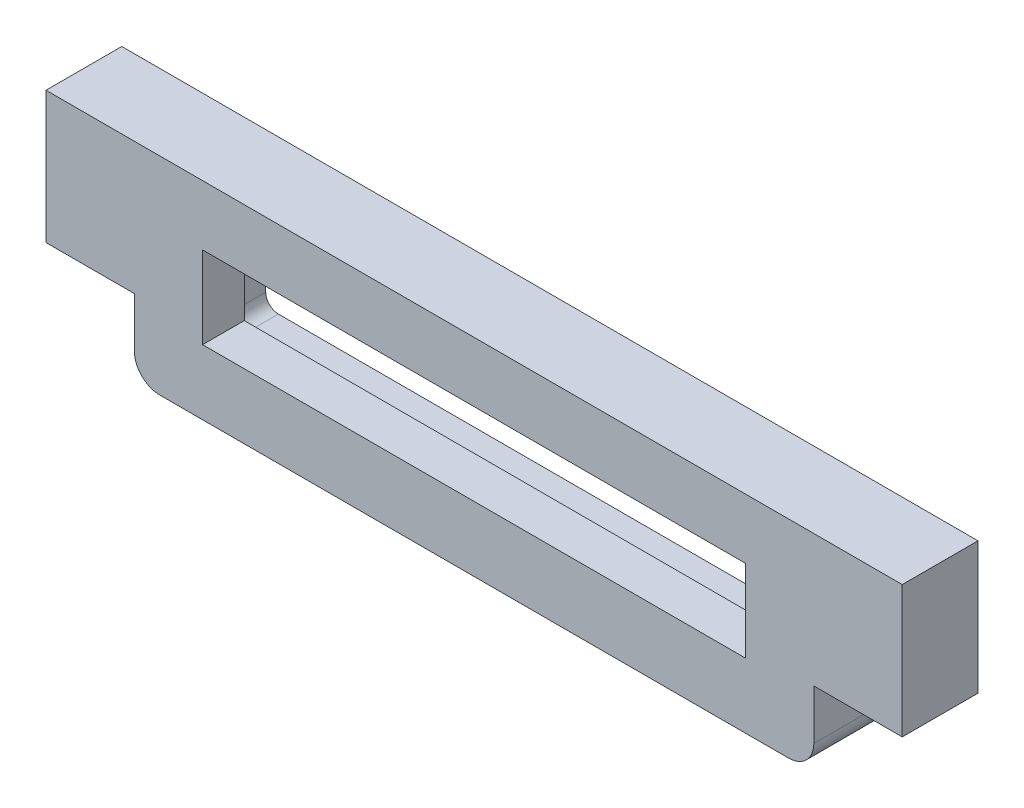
ISO-10303-21;
HEADER;
FILE_DESCRIPTION(('STEP AP214'),'2;1');
FILE_NAME('part.step','',(''),(''),'','','');
FILE_SCHEMA(('AUTOMOTIVE_DESIGN { 1 0 10303 214 1 1 1 1 }'));
ENDSEC;
DATA;
#1=APPLICATION_CONTEXT('core data for automotive mechanical design processes');
#2=APPLICATION_PROTOCOL_DEFINITION('international standard','automotive_design',2000,#1);
#3=PRODUCT_CONTEXT('',#1,'mechanical');
#4=PRODUCT('Part','Part','',(#3));
#5=PRODUCT_RELATED_PRODUCT_CATEGORY('part','',(#4));
#6=PRODUCT_DEFINITION_FORMATION('','',#4);
#7=PRODUCT_DEFINITION_CONTEXT('part definition',#1,'design');
#8=PRODUCT_DEFINITION('design','',#6,#7);
#9=PRODUCT_DEFINITION_SHAPE('','',#8);
#10=(LENGTH_UNIT() NAMED_UNIT(*) SI_UNIT(.MILLI.,.METRE.));
#11=(NAMED_UNIT(*) PLANE_ANGLE_UNIT() SI_UNIT($,.RADIAN.));
#12=(NAMED_UNIT(*) SI_UNIT($,.STERADIAN.) SOLID_ANGLE_UNIT());
#13=UNCERTAINTY_MEASURE_WITH_UNIT(LENGTH_MEASURE(1.E-05),#10,'distance_accuracy_value','');
#14=(GEOMETRIC_REPRESENTATION_CONTEXT(3) GLOBAL_UNCERTAINTY_ASSIGNED_CONTEXT((#13)) GLOBAL_UNIT_ASSIGNED_CONTEXT((#10,
#11,#12)) REPRESENTATION_CONTEXT('',''));
#15=CARTESIAN_POINT('',(0.,0.,0.));
#16=DIRECTION('',(0.,0.,1.));
#17=DIRECTION('',(1.,0.,0.));
#18=AXIS2_PLACEMENT_3D('',#15,#16,#17);
#19=CARTESIAN_POINT('',(-26.9,8.4,27.));
#20=DIRECTION('',(1.,0.,0.));
#21=DIRECTION('',(0.,0.,-1.));
#22=AXIS2_PLACEMENT_3D('',#19,#20,#21);
#23=PLANE('',#22);
#24=DIRECTION('',(0.,0.,-1.));
#25=VECTOR('',#24,1.);
#26=CARTESIAN_POINT('',(-26.9,-6.4,27.));
#27=LINE('',#26,#25);
#28=CARTESIAN_POINT('',(-26.9,-6.4,19.35));
#29=VERTEX_POINT('',#28);
#30=CARTESIAN_POINT('',(-26.9,-6.4,25.35));
#31=VERTEX_POINT('',#30);
#32=EDGE_CURVE('E325',#29,#31,#27,.F.);
#33=ORIENTED_EDGE('',*,*,#32,.T.);
#34=DIRECTION('',(0.,-1.,0.));
#35=VECTOR('',#34,1.);
#36=CARTESIAN_POINT('',(-26.9,-8.4,25.35));
#37=LINE('',#36,#35);
#38=CARTESIAN_POINT('',(-26.9,-2.44999999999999,25.35));
#39=VERTEX_POINT('',#38);
#40=EDGE_CURVE('E251',#39,#31,#37,.T.);
#41=ORIENTED_EDGE('',*,*,#40,.F.);
#42=DIRECTION('',(0.,0.,-1.));
#43=VECTOR('',#42,1.);
#44=CARTESIAN_POINT('',(-26.9,-2.44999999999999,25.35));
#45=LINE('',#44,#43);
#46=CARTESIAN_POINT('',(-26.9,-2.44999999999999,19.35));
#47=VERTEX_POINT('',#46);
#48=EDGE_CURVE('E290',#39,#47,#45,.T.);
#49=ORIENTED_EDGE('',*,*,#48,.T.);
#50=DIRECTION('',(0.,-1.,0.));
#51=VECTOR('',#50,1.);
#52=CARTESIAN_POINT('',(-26.9,8.4,19.35));
#53=LINE('',#52,#51);
#54=EDGE_CURVE('E305',#47,#29,#53,.T.);
#55=ORIENTED_EDGE('',*,*,#54,.T.);
#56=EDGE_LOOP('',(#33,#41,#49,#55));
#57=FACE_BOUND('',#56,.T.);
#58=ADVANCED_FACE('F39',(#57),#23,.F.);
#59=CARTESIAN_POINT('',(26.9,8.4,27.));
#60=DIRECTION('',(-1.,0.,0.));
#61=DIRECTION('',(0.,0.,1.));
#62=AXIS2_PLACEMENT_3D('',#59,#60,#61);
#63=PLANE('',#62);
#64=DIRECTION('',(0.,0.,-1.));
#65=VECTOR('',#64,1.);
#66=CARTESIAN_POINT('',(26.9,-2.45,25.35));
#67=LINE('',#66,#65);
#68=CARTESIAN_POINT('',(26.9,-2.45,25.35));
#69=VERTEX_POINT('',#68);
#70=CARTESIAN_POINT('',(26.9,-2.45,19.35));
#71=VERTEX_POINT('',#70);
#72=EDGE_CURVE('E302',#69,#71,#67,.T.);
#73=ORIENTED_EDGE('',*,*,#72,.F.);
#74=DIRECTION('',(0.,1.,0.));
#75=VECTOR('',#74,1.);
#76=CARTESIAN_POINT('',(26.9,-8.4,25.35));
#77=LINE('',#76,#75);
#78=CARTESIAN_POINT('',(26.9,-6.4,25.35));
#79=VERTEX_POINT('',#78);
#80=EDGE_CURVE('E262',#79,#69,#77,.T.);
#81=ORIENTED_EDGE('',*,*,#80,.F.);
#82=DIRECTION('',(0.,0.,-1.));
#83=VECTOR('',#82,1.);
#84=CARTESIAN_POINT('',(26.9,-6.4,27.));
#85=LINE('',#84,#83);
#86=CARTESIAN_POINT('',(26.9,-6.4,19.35));
#87=VERTEX_POINT('',#86);
#88=EDGE_CURVE('E314',#79,#87,#85,.T.);
#89=ORIENTED_EDGE('',*,*,#88,.T.);
#90=DIRECTION('',(0.,1.,0.));
#91=VECTOR('',#90,1.);
#92=CARTESIAN_POINT('',(26.9,-8.4,19.35));
#93=LINE('',#92,#91);
#94=EDGE_CURVE('E312',#87,#71,#93,.T.);
#95=ORIENTED_EDGE('',*,*,#94,.T.);
#96=EDGE_LOOP('',(#73,#81,#89,#95));
#97=FACE_BOUND('',#96,.T.);
#98=ADVANCED_FACE('F394',(#97),#63,.F.);
#99=CARTESIAN_POINT('',(26.9,-8.4,27.));
#100=DIRECTION('',(0.,1.,0.));
#101=DIRECTION('',(0.,0.,1.));
#102=AXIS2_PLACEMENT_3D('',#99,#100,#101);
#103=PLANE('',#102);
#104=DIRECTION('',(0.,0.,-1.));
#105=VECTOR('',#104,1.);
#106=CARTESIAN_POINT('',(24.9,-8.4,27.));
#107=LINE('',#106,#105);
#108=CARTESIAN_POINT('',(24.9,-8.4,19.35));
#109=VERTEX_POINT('',#108);
#110=CARTESIAN_POINT('',(24.9,-8.4,25.35));
#111=VERTEX_POINT('',#110);
#112=EDGE_CURVE('E322',#109,#111,#107,.F.);
#113=ORIENTED_EDGE('',*,*,#112,.T.);
#114=DIRECTION('',(1.,0.,0.));
#115=VECTOR('',#114,1.);
#116=CARTESIAN_POINT('',(-26.9,-8.4,25.35));
#117=LINE('',#116,#115);
#118=CARTESIAN_POINT('',(-24.9,-8.4,25.35));
#119=VERTEX_POINT('',#118);
#120=EDGE_CURVE('E265',#119,#111,#117,.T.);
#121=ORIENTED_EDGE('',*,*,#120,.F.);
#122=DIRECTION('',(0.,0.,-1.));
#123=VECTOR('',#122,1.);
#124=CARTESIAN_POINT('',(-24.9,-8.4,27.));
#125=LINE('',#124,#123);
#126=CARTESIAN_POINT('',(-24.9,-8.4,19.35));
#127=VERTEX_POINT('',#126);
#128=EDGE_CURVE('E320',#119,#127,#125,.T.);
#129=ORIENTED_EDGE('',*,*,#128,.T.);
#130=DIRECTION('',(1.,0.,0.));
#131=VECTOR('',#130,1.);
#132=CARTESIAN_POINT('',(-26.9,-8.4,19.35));
#133=LINE('',#132,#131);
#134=EDGE_CURVE('E309',#127,#109,#133,.T.);
#135=ORIENTED_EDGE('',*,*,#134,.T.);
#136=EDGE_LOOP('',(#113,#121,#129,#135));
#137=FACE_BOUND('',#136,.T.);
#138=ADVANCED_FACE('F400',(#137),#103,.F.);
#139=CARTESIAN_POINT('',(0.,0.,19.35));
#140=DIRECTION('',(0.,0.,1.));
#141=DIRECTION('',(1.,0.,0.));
#142=AXIS2_PLACEMENT_3D('',#139,#140,#141);
#143=PLANE('',#142);
#144=DIRECTION('',(-1.,0.,0.));
#145=VECTOR('',#144,1.);
#146=CARTESIAN_POINT('',(-26.1,8.,19.35));
#147=LINE('',#146,#145);
#148=CARTESIAN_POINT('',(33.9,8.,19.35));
#149=VERTEX_POINT('',#148);
#150=CARTESIAN_POINT('',(-33.9,8.,19.35));
#151=VERTEX_POINT('',#150);
#152=EDGE_CURVE('E211',#149,#151,#147,.T.);
#153=ORIENTED_EDGE('',*,*,#152,.F.);
#154=DIRECTION('',(0.,1.,0.));
#155=VECTOR('',#154,1.);
#156=CARTESIAN_POINT('',(33.9,0.,19.35));
#157=LINE('',#156,#155);
#158=CARTESIAN_POINT('',(33.9,-2.45,19.35));
#159=VERTEX_POINT('',#158);
#160=EDGE_CURVE('E216',#159,#149,#157,.T.);
#161=ORIENTED_EDGE('',*,*,#160,.F.);
#162=DIRECTION('',(1.,0.,0.));
#163=VECTOR('',#162,1.);
#164=CARTESIAN_POINT('',(0.,-2.45,19.35));
#165=LINE('',#164,#163);
#166=EDGE_CURVE('E202',#71,#159,#165,.T.);
#167=ORIENTED_EDGE('',*,*,#166,.F.);
#168=ORIENTED_EDGE('',*,*,#94,.F.);
#169=CARTESIAN_POINT('',(24.9,-6.4,19.35));
#170=DIRECTION('',(0.,0.,1.));
#171=DIRECTION('',(1.,0.,0.));
#172=AXIS2_PLACEMENT_3D('',#169,#170,#171);
#173=CIRCLE('',#172,2.);
#174=EDGE_CURVE('E318',#87,#109,#173,.F.);
#175=ORIENTED_EDGE('',*,*,#174,.T.);
#176=ORIENTED_EDGE('',*,*,#134,.F.);
#177=CARTESIAN_POINT('',(-24.9,-6.4,19.35));
#178=DIRECTION('',(0.,0.,1.));
#179=DIRECTION('',(1.,0.,0.));
#180=AXIS2_PLACEMENT_3D('',#177,#178,#179);
#181=CIRCLE('',#180,2.);
#182=EDGE_CURVE('E316',#127,#29,#181,.F.);
#183=ORIENTED_EDGE('',*,*,#182,.T.);
#184=ORIENTED_EDGE('',*,*,#54,.F.);
#185=DIRECTION('',(-1.,0.,0.));
#186=VECTOR('',#185,1.);
#187=CARTESIAN_POINT('',(0.,-2.45,19.35));
#188=LINE('',#187,#186);
#189=CARTESIAN_POINT('',(-33.9,-2.44999999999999,19.35));
#190=VERTEX_POINT('',#189);
#191=EDGE_CURVE('E275',#47,#190,#188,.T.);
#192=ORIENTED_EDGE('',*,*,#191,.T.);
#193=DIRECTION('',(0.,1.,0.));
#194=VECTOR('',#193,1.);
#195=CARTESIAN_POINT('',(-33.9,0.,19.35));
#196=LINE('',#195,#194);
#197=EDGE_CURVE('E288',#190,#151,#196,.T.);
#198=ORIENTED_EDGE('',*,*,#197,.T.);
#199=EDGE_LOOP('',(#153,#161,#167,#168,#175,#176,#183,#184,#192,#198));
#200=FACE_BOUND('',#199,.T.);
#201=DIRECTION('',(1.,0.,0.));
#202=VECTOR('',#201,1.);
#203=CARTESIAN_POINT('',(22.5,4.15,19.35));
#204=LINE('',#203,#202);
#205=CARTESIAN_POINT('',(-21.5,4.15000000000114,19.35));
#206=VERTEX_POINT('',#205);
#207=CARTESIAN_POINT('',(21.5,4.15000000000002,19.35));
#208=VERTEX_POINT('',#207);
#209=EDGE_CURVE('E237',#206,#208,#204,.T.);
#210=ORIENTED_EDGE('',*,*,#209,.F.);
#211=CARTESIAN_POINT('',(-21.5,3.15000000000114,19.35));
#212=DIRECTION('',(0.,0.,1.));
#213=DIRECTION('',(1.,0.,0.));
#214=AXIS2_PLACEMENT_3D('',#211,#212,#213);
#215=CIRCLE('',#214,1.);
#216=CARTESIAN_POINT('',(-22.5,3.15000000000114,19.35));
#217=VERTEX_POINT('',#216);
#218=EDGE_CURVE('E356',#206,#217,#215,.T.);
#219=ORIENTED_EDGE('',*,*,#218,.T.);
#220=DIRECTION('',(0.,1.,0.));
#221=VECTOR('',#220,1.);
#222=CARTESIAN_POINT('',(-22.5,4.15,19.35));
#223=LINE('',#222,#221);
#224=CARTESIAN_POINT('',(-22.5,-3.15000000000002,19.35));
#225=VERTEX_POINT('',#224);
#226=EDGE_CURVE('E242',#225,#217,#223,.T.);
#227=ORIENTED_EDGE('',*,*,#226,.F.);
#228=CARTESIAN_POINT('',(-21.5,-3.15000000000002,19.35));
#229=DIRECTION('',(0.,0.,1.));
#230=DIRECTION('',(1.,0.,0.));
#231=AXIS2_PLACEMENT_3D('',#228,#229,#230);
#232=CIRCLE('',#231,1.);
#233=CARTESIAN_POINT('',(-21.5,-4.15000000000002,19.35));
#234=VERTEX_POINT('',#233);
#235=EDGE_CURVE('E358',#225,#234,#232,.T.);
#236=ORIENTED_EDGE('',*,*,#235,.T.);
#237=DIRECTION('',(-1.,0.,0.));
#238=VECTOR('',#237,1.);
#239=CARTESIAN_POINT('',(-22.5,-4.15,19.35));
#240=LINE('',#239,#238);
#241=CARTESIAN_POINT('',(21.5,-4.15000000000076,19.35));
#242=VERTEX_POINT('',#241);
#243=EDGE_CURVE('E257',#242,#234,#240,.T.);
#244=ORIENTED_EDGE('',*,*,#243,.F.);
#245=CARTESIAN_POINT('',(21.5,-3.15000000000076,19.35));
#246=DIRECTION('',(0.,0.,1.));
#247=DIRECTION('',(1.,0.,0.));
#248=AXIS2_PLACEMENT_3D('',#245,#246,#247);
#249=CIRCLE('',#248,1.);
#250=CARTESIAN_POINT('',(22.5,-3.15000000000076,19.35));
#251=VERTEX_POINT('',#250);
#252=EDGE_CURVE('E360',#242,#251,#249,.T.);
#253=ORIENTED_EDGE('',*,*,#252,.T.);
#254=DIRECTION('',(0.,-1.,0.));
#255=VECTOR('',#254,1.);
#256=CARTESIAN_POINT('',(22.5,-4.15000000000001,19.35));
#257=LINE('',#256,#255);
#258=CARTESIAN_POINT('',(22.5,3.15000000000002,19.35));
#259=VERTEX_POINT('',#258);
#260=EDGE_CURVE('E254',#259,#251,#257,.T.);
#261=ORIENTED_EDGE('',*,*,#260,.F.);
#262=CARTESIAN_POINT('',(21.5,3.15000000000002,19.35));
#263=DIRECTION('',(0.,0.,1.));
#264=DIRECTION('',(1.,0.,0.));
#265=AXIS2_PLACEMENT_3D('',#262,#263,#264);
#266=CIRCLE('',#265,1.);
#267=EDGE_CURVE('E362',#259,#208,#266,.T.);
#268=ORIENTED_EDGE('',*,*,#267,.T.);
#269=EDGE_LOOP('',(#210,#219,#227,#236,#244,#253,#261,#268));
#270=FACE_BOUND('',#269,.T.);
#271=ADVANCED_FACE('F457',(#200,#270),#143,.F.);
#272=CARTESIAN_POINT('',(33.9,0.,25.35));
#273=DIRECTION('',(-1.,0.,0.));
#274=DIRECTION('',(0.,-1.,0.));
#275=AXIS2_PLACEMENT_3D('',#272,#273,#274);
#276=PLANE('',#275);
#277=ORIENTED_EDGE('',*,*,#160,.T.);
#278=DIRECTION('',(0.,0.,1.));
#279=VECTOR('',#278,1.);
#280=CARTESIAN_POINT('',(33.9,8.,11.5370300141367));
#281=LINE('',#280,#279);
#282=CARTESIAN_POINT('',(33.9,8.,25.35));
#283=VERTEX_POINT('',#282);
#284=EDGE_CURVE('E208',#149,#283,#281,.T.);
#285=ORIENTED_EDGE('',*,*,#284,.T.);
#286=DIRECTION('',(0.,1.,0.));
#287=VECTOR('',#286,1.);
#288=CARTESIAN_POINT('',(33.9,0.,25.35));
#289=LINE('',#288,#287);
#290=CARTESIAN_POINT('',(33.9,-2.45,25.35));
#291=VERTEX_POINT('',#290);
#292=EDGE_CURVE('E189',#291,#283,#289,.T.);
#293=ORIENTED_EDGE('',*,*,#292,.F.);
#294=DIRECTION('',(0.,0.,-1.));
#295=VECTOR('',#294,1.);
#296=CARTESIAN_POINT('',(33.9,-2.45,25.35));
#297=LINE('',#296,#295);
#298=EDGE_CURVE('E299',#291,#159,#297,.T.);
#299=ORIENTED_EDGE('',*,*,#298,.T.);
#300=EDGE_LOOP('',(#277,#285,#293,#299));
#301=FACE_BOUND('',#300,.T.);
#302=ADVANCED_FACE('F214',(#301),#276,.F.);
#303=CARTESIAN_POINT('',(0.,-2.45,25.35));
#304=DIRECTION('',(0.,1.,0.));
#305=DIRECTION('',(-1.,0.,0.));
#306=AXIS2_PLACEMENT_3D('',#303,#304,#305);
#307=PLANE('',#306);
#308=CARTESIAN_POINT('',(30.7,-2.45,22.35));
#309=DIRECTION('',(0.,-1.,0.));
#310=DIRECTION('',(1.,0.,0.));
#311=AXIS2_PLACEMENT_3D('',#308,#309,#310);
#312=CIRCLE('',#311,1.35000000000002);
#313=CARTESIAN_POINT('',(32.05,-2.45,22.35));
#314=VERTEX_POINT('',#313);
#315=EDGE_CURVE('E279',#314,#314,#312,.F.);
#316=ORIENTED_EDGE('',*,*,#315,.T.);
#317=EDGE_LOOP('',(#316));
#318=FACE_BOUND('',#317,.T.);
#319=ORIENTED_EDGE('',*,*,#166,.T.);
#320=ORIENTED_EDGE('',*,*,#298,.F.);
#321=DIRECTION('',(1.,0.,0.));
#322=VECTOR('',#321,1.);
#323=CARTESIAN_POINT('',(0.,-2.45,25.35));
#324=LINE('',#323,#322);
#325=EDGE_CURVE('E197',#69,#291,#324,.T.);
#326=ORIENTED_EDGE('',*,*,#325,.F.);
#327=ORIENTED_EDGE('',*,*,#72,.T.);
#328=EDGE_LOOP('',(#319,#320,#326,#327));
#329=FACE_BOUND('',#328,.T.);
#330=ADVANCED_FACE('F465',(#318,#329),#307,.F.);
#331=CARTESIAN_POINT('',(0.,0.,25.35));
#332=DIRECTION('',(0.,0.,-1.));
#333=DIRECTION('',(-1.,0.,0.));
#334=AXIS2_PLACEMENT_3D('',#331,#332,#333);
#335=PLANE('',#334);
#336=ORIENTED_EDGE('',*,*,#292,.T.);
#337=DIRECTION('',(1.,0.,0.));
#338=VECTOR('',#337,1.);
#339=CARTESIAN_POINT('',(-26.1,8.,25.35));
#340=LINE('',#339,#338);
#341=CARTESIAN_POINT('',(-33.9,8.,25.35));
#342=VERTEX_POINT('',#341);
#343=EDGE_CURVE('E194',#342,#283,#340,.T.);
#344=ORIENTED_EDGE('',*,*,#343,.F.);
#345=DIRECTION('',(0.,1.,0.));
#346=VECTOR('',#345,1.);
#347=CARTESIAN_POINT('',(-33.9,0.,25.35));
#348=LINE('',#347,#346);
#349=CARTESIAN_POINT('',(-33.9,-2.44999999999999,25.35));
#350=VERTEX_POINT('',#349);
#351=EDGE_CURVE('E287',#350,#342,#348,.T.);
#352=ORIENTED_EDGE('',*,*,#351,.F.);
#353=DIRECTION('',(-1.,0.,0.));
#354=VECTOR('',#353,1.);
#355=CARTESIAN_POINT('',(0.,-2.45,25.35));
#356=LINE('',#355,#354);
#357=EDGE_CURVE('E284',#39,#350,#356,.T.);
#358=ORIENTED_EDGE('',*,*,#357,.F.);
#359=ORIENTED_EDGE('',*,*,#40,.T.);
#360=CARTESIAN_POINT('',(-24.9,-6.4,25.35));
#361=DIRECTION('',(0.,0.,-1.));
#362=DIRECTION('',(-1.,0.,0.));
#363=AXIS2_PLACEMENT_3D('',#360,#361,#362);
#364=CIRCLE('',#363,2.);
#365=EDGE_CURVE('E264',#31,#119,#364,.F.);
#366=ORIENTED_EDGE('',*,*,#365,.T.);
#367=ORIENTED_EDGE('',*,*,#120,.T.);
#368=CARTESIAN_POINT('',(24.9,-6.4,25.35));
#369=DIRECTION('',(0.,0.,-1.));
#370=DIRECTION('',(-1.,0.,0.));
#371=AXIS2_PLACEMENT_3D('',#368,#369,#370);
#372=CIRCLE('',#371,2.);
#373=EDGE_CURVE('E269',#111,#79,#372,.F.);
#374=ORIENTED_EDGE('',*,*,#373,.T.);
#375=ORIENTED_EDGE('',*,*,#80,.T.);
#376=ORIENTED_EDGE('',*,*,#325,.T.);
#377=EDGE_LOOP('',(#336,#344,#352,#358,#359,#366,#367,#374,#375,#376));
#378=FACE_BOUND('',#377,.T.);
#379=DIRECTION('',(0.,-1.,0.));
#380=VECTOR('',#379,1.);
#381=CARTESIAN_POINT('',(-21.5,-3.25000000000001,25.35));
#382=LINE('',#381,#380);
#383=CARTESIAN_POINT('',(-21.5,3.25,25.35));
#384=VERTEX_POINT('',#383);
#385=CARTESIAN_POINT('',(-21.5,-3.25000000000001,25.35));
#386=VERTEX_POINT('',#385);
#387=EDGE_CURVE('E222',#384,#386,#382,.T.);
#388=ORIENTED_EDGE('',*,*,#387,.F.);
#389=DIRECTION('',(-1.,0.,0.));
#390=VECTOR('',#389,1.);
#391=CARTESIAN_POINT('',(-21.5,3.25,25.35));
#392=LINE('',#391,#390);
#393=CARTESIAN_POINT('',(21.5,3.25,25.35));
#394=VERTEX_POINT('',#393);
#395=EDGE_CURVE('E54',#394,#384,#392,.T.);
#396=ORIENTED_EDGE('',*,*,#395,.F.);
#397=DIRECTION('',(0.,1.,0.));
#398=VECTOR('',#397,1.);
#399=CARTESIAN_POINT('',(21.5,3.25,25.35));
#400=LINE('',#399,#398);
#401=CARTESIAN_POINT('',(21.5,-3.25,25.35));
#402=VERTEX_POINT('',#401);
#403=EDGE_CURVE('E227',#402,#394,#400,.T.);
#404=ORIENTED_EDGE('',*,*,#403,.F.);
#405=DIRECTION('',(1.,0.,0.));
#406=VECTOR('',#405,1.);
#407=CARTESIAN_POINT('',(21.5,-3.25,25.35));
#408=LINE('',#407,#406);
#409=EDGE_CURVE('E224',#386,#402,#408,.T.);
#410=ORIENTED_EDGE('',*,*,#409,.F.);
#411=EDGE_LOOP('',(#388,#396,#404,#410));
#412=FACE_BOUND('',#411,.T.);
#413=ADVANCED_FACE('F191',(#378,#412),#335,.F.);
#414=CARTESIAN_POINT('',(-33.9,0.,25.35));
#415=DIRECTION('',(-1.,0.,0.));
#416=DIRECTION('',(0.,-1.,0.));
#417=AXIS2_PLACEMENT_3D('',#414,#415,#416);
#418=PLANE('',#417);
#419=ORIENTED_EDGE('',*,*,#197,.F.);
#420=DIRECTION('',(0.,0.,-1.));
#421=VECTOR('',#420,1.);
#422=CARTESIAN_POINT('',(-33.9,-2.44999999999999,25.35));
#423=LINE('',#422,#421);
#424=EDGE_CURVE('E294',#350,#190,#423,.T.);
#425=ORIENTED_EDGE('',*,*,#424,.F.);
#426=ORIENTED_EDGE('',*,*,#351,.T.);
#427=DIRECTION('',(0.,0.,1.));
#428=VECTOR('',#427,1.);
#429=CARTESIAN_POINT('',(-33.9,8.,11.5370300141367));
#430=LINE('',#429,#428);
#431=EDGE_CURVE('E210',#151,#342,#430,.T.);
#432=ORIENTED_EDGE('',*,*,#431,.F.);
#433=EDGE_LOOP('',(#419,#425,#426,#432));
#434=FACE_BOUND('',#433,.T.);
#435=ADVANCED_FACE('F476',(#434),#418,.T.);
#436=CARTESIAN_POINT('',(0.,-2.45,25.35));
#437=DIRECTION('',(0.,-1.,0.));
#438=DIRECTION('',(1.,0.,0.));
#439=AXIS2_PLACEMENT_3D('',#436,#437,#438);
#440=PLANE('',#439);
#441=CARTESIAN_POINT('',(-30.7,-2.44999999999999,22.35));
#442=DIRECTION('',(0.,-1.,0.));
#443=DIRECTION('',(1.,0.,0.));
#444=AXIS2_PLACEMENT_3D('',#441,#442,#443);
#445=CIRCLE('',#444,1.35000000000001);
#446=CARTESIAN_POINT('',(-29.35,-2.44999999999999,22.35));
#447=VERTEX_POINT('',#446);
#448=EDGE_CURVE('E276',#447,#447,#445,.T.);
#449=ORIENTED_EDGE('',*,*,#448,.F.);
#450=EDGE_LOOP('',(#449));
#451=FACE_BOUND('',#450,.T.);
#452=ORIENTED_EDGE('',*,*,#191,.F.);
#453=ORIENTED_EDGE('',*,*,#48,.F.);
#454=ORIENTED_EDGE('',*,*,#357,.T.);
#455=ORIENTED_EDGE('',*,*,#424,.T.);
#456=EDGE_LOOP('',(#452,#453,#454,#455));
#457=FACE_BOUND('',#456,.T.);
#458=ADVANCED_FACE('F472',(#451,#457),#440,.T.);
#459=CARTESIAN_POINT('',(-30.7,5.55000000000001,22.35));
#460=DIRECTION('',(0.,-1.,0.));
#461=DIRECTION('',(1.,0.,0.));
#462=AXIS2_PLACEMENT_3D('',#459,#460,#461);
#463=CYLINDRICAL_SURFACE('',#462,1.35000000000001);
#464=CARTESIAN_POINT('',(-30.7,5.55000000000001,22.35));
#465=DIRECTION('',(0.,-1.,0.));
#466=DIRECTION('',(1.,0.,0.));
#467=AXIS2_PLACEMENT_3D('',#464,#465,#466);
#468=CIRCLE('',#467,1.35000000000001);
#469=CARTESIAN_POINT('',(-29.35,5.55000000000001,22.35));
#470=VERTEX_POINT('',#469);
#471=EDGE_CURVE('E272',#470,#470,#468,.T.);
#472=ORIENTED_EDGE('',*,*,#471,.F.);
#473=EDGE_LOOP('',(#472));
#474=FACE_BOUND('',#473,.T.);
#475=ORIENTED_EDGE('',*,*,#448,.T.);
#476=EDGE_LOOP('',(#475));
#477=FACE_BOUND('',#476,.T.);
#478=ADVANCED_FACE('F475',(#474,#477),#463,.F.);
#479=CARTESIAN_POINT('',(0.,5.55,0.));
#480=DIRECTION('',(0.,-1.,0.));
#481=DIRECTION('',(1.,0.,0.));
#482=AXIS2_PLACEMENT_3D('',#479,#480,#481);
#483=PLANE('',#482);
#484=ORIENTED_EDGE('',*,*,#471,.T.);
#485=EDGE_LOOP('',(#484));
#486=FACE_BOUND('',#485,.T.);
#487=ADVANCED_FACE('F489',(#486),#483,.T.);
#488=CARTESIAN_POINT('',(30.7,5.55,22.35));
#489=DIRECTION('',(0.,-1.,0.));
#490=DIRECTION('',(1.,0.,0.));
#491=AXIS2_PLACEMENT_3D('',#488,#489,#490);
#492=CYLINDRICAL_SURFACE('',#491,1.35000000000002);
#493=CARTESIAN_POINT('',(30.7,5.55,22.35));
#494=DIRECTION('',(0.,-1.,0.));
#495=DIRECTION('',(1.,0.,0.));
#496=AXIS2_PLACEMENT_3D('',#493,#494,#495);
#497=CIRCLE('',#496,1.35000000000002);
#498=CARTESIAN_POINT('',(32.05,5.55,22.35));
#499=VERTEX_POINT('',#498);
#500=EDGE_CURVE('E271',#499,#499,#497,.F.);
#501=ORIENTED_EDGE('',*,*,#500,.T.);
#502=EDGE_LOOP('',(#501));
#503=FACE_BOUND('',#502,.T.);
#504=ORIENTED_EDGE('',*,*,#315,.F.);
#505=EDGE_LOOP('',(#504));
#506=FACE_BOUND('',#505,.T.);
#507=ADVANCED_FACE('F485',(#503,#506),#492,.F.);
#508=CARTESIAN_POINT('',(0.,5.55,0.));
#509=DIRECTION('',(0.,-1.,0.));
#510=DIRECTION('',(1.,0.,0.));
#511=AXIS2_PLACEMENT_3D('',#508,#509,#510);
#512=PLANE('',#511);
#513=ORIENTED_EDGE('',*,*,#500,.F.);
#514=EDGE_LOOP('',(#513));
#515=FACE_BOUND('',#514,.T.);
#516=ADVANCED_FACE('F409',(#515),#512,.T.);
#517=CARTESIAN_POINT('',(24.9,-6.4,27.));
#518=DIRECTION('',(0.,0.,-1.));
#519=DIRECTION('',(-1.,0.,0.));
#520=AXIS2_PLACEMENT_3D('',#517,#518,#519);
#521=CYLINDRICAL_SURFACE('',#520,2.);
#522=ORIENTED_EDGE('',*,*,#373,.F.);
#523=ORIENTED_EDGE('',*,*,#112,.F.);
#524=ORIENTED_EDGE('',*,*,#174,.F.);
#525=ORIENTED_EDGE('',*,*,#88,.F.);
#526=EDGE_LOOP('',(#522,#523,#524,#525));
#527=FACE_BOUND('',#526,.T.);
#528=ADVANCED_FACE('F405',(#527),#521,.T.);
#529=CARTESIAN_POINT('',(-24.9,-6.4,27.));
#530=DIRECTION('',(0.,0.,-1.));
#531=DIRECTION('',(-1.,0.,0.));
#532=AXIS2_PLACEMENT_3D('',#529,#530,#531);
#533=CYLINDRICAL_SURFACE('',#532,2.);
#534=ORIENTED_EDGE('',*,*,#365,.F.);
#535=ORIENTED_EDGE('',*,*,#32,.F.);
#536=ORIENTED_EDGE('',*,*,#182,.F.);
#537=ORIENTED_EDGE('',*,*,#128,.F.);
#538=EDGE_LOOP('',(#534,#535,#536,#537));
#539=FACE_BOUND('',#538,.T.);
#540=ADVANCED_FACE('F408',(#539),#533,.T.);
#541=CARTESIAN_POINT('',(-22.5,4.15,22.05));
#542=DIRECTION('',(-1.,0.,0.));
#543=DIRECTION('',(0.,0.,1.));
#544=AXIS2_PLACEMENT_3D('',#541,#542,#543);
#545=PLANE('',#544);
#546=ORIENTED_EDGE('',*,*,#226,.T.);
#547=DIRECTION('',(0.,0.,-1.));
#548=VECTOR('',#547,1.);
#549=CARTESIAN_POINT('',(-22.5,3.15000000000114,22.05));
#550=LINE('',#549,#548);
#551=CARTESIAN_POINT('',(-22.5,3.15000000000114,22.05));
#552=VERTEX_POINT('',#551);
#553=EDGE_CURVE('E336',#217,#552,#550,.F.);
#554=ORIENTED_EDGE('',*,*,#553,.T.);
#555=DIRECTION('',(0.,1.,0.));
#556=VECTOR('',#555,1.);
#557=CARTESIAN_POINT('',(-22.5,4.15,22.05));
#558=LINE('',#557,#556);
#559=CARTESIAN_POINT('',(-22.5,-3.15000000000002,22.05));
#560=VERTEX_POINT('',#559);
#561=EDGE_CURVE('E248',#560,#552,#558,.T.);
#562=ORIENTED_EDGE('',*,*,#561,.F.);
#563=DIRECTION('',(0.,0.,-1.));
#564=VECTOR('',#563,1.);
#565=CARTESIAN_POINT('',(-22.5,-3.15000000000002,19.35));
#566=LINE('',#565,#564);
#567=EDGE_CURVE('E333',#560,#225,#566,.T.);
#568=ORIENTED_EDGE('',*,*,#567,.T.);
#569=EDGE_LOOP('',(#546,#554,#562,#568));
#570=FACE_BOUND('',#569,.T.);
#571=ADVANCED_FACE('F413',(#570),#545,.F.);
#572=CARTESIAN_POINT('',(-22.5,-4.15,22.05));
#573=DIRECTION('',(0.,-1.,0.));
#574=DIRECTION('',(1.,0.,0.));
#575=AXIS2_PLACEMENT_3D('',#572,#573,#574);
#576=PLANE('',#575);
#577=ORIENTED_EDGE('',*,*,#243,.T.);
#578=DIRECTION('',(0.,0.,-1.));
#579=VECTOR('',#578,1.);
#580=CARTESIAN_POINT('',(-21.5,-4.15000000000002,22.05));
#581=LINE('',#580,#579);
#582=CARTESIAN_POINT('',(-21.5,-4.15000000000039,22.05));
#583=VERTEX_POINT('',#582);
#584=EDGE_CURVE('E349',#234,#583,#581,.F.);
#585=ORIENTED_EDGE('',*,*,#584,.T.);
#586=DIRECTION('',(-1.,0.,0.));
#587=VECTOR('',#586,1.);
#588=CARTESIAN_POINT('',(22.5,-4.15000000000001,22.05));
#589=LINE('',#588,#587);
#590=CARTESIAN_POINT('',(21.5,-4.15000000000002,22.05));
#591=VERTEX_POINT('',#590);
#592=EDGE_CURVE('E245',#591,#583,#589,.T.);
#593=ORIENTED_EDGE('',*,*,#592,.F.);
#594=DIRECTION('',(0.,0.,-1.));
#595=VECTOR('',#594,1.);
#596=CARTESIAN_POINT('',(21.5,-4.15000000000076,19.35));
#597=LINE('',#596,#595);
#598=EDGE_CURVE('E346',#591,#242,#597,.T.);
#599=ORIENTED_EDGE('',*,*,#598,.T.);
#600=EDGE_LOOP('',(#577,#585,#593,#599));
#601=FACE_BOUND('',#600,.T.);
#602=ADVANCED_FACE('F436',(#601),#576,.F.);
#603=CARTESIAN_POINT('',(22.5,-4.15000000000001,22.05));
#604=DIRECTION('',(1.,0.,0.));
#605=DIRECTION('',(0.,0.,-1.));
#606=AXIS2_PLACEMENT_3D('',#603,#604,#605);
#607=PLANE('',#606);
#608=ORIENTED_EDGE('',*,*,#260,.T.);
#609=DIRECTION('',(0.,0.,-1.));
#610=VECTOR('',#609,1.);
#611=CARTESIAN_POINT('',(22.5,-3.15000000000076,22.05));
#612=LINE('',#611,#610);
#613=CARTESIAN_POINT('',(22.5,-3.15000000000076,22.05));
#614=VERTEX_POINT('',#613);
#615=EDGE_CURVE('E354',#251,#614,#612,.F.);
#616=ORIENTED_EDGE('',*,*,#615,.T.);
#617=DIRECTION('',(0.,-1.,0.));
#618=VECTOR('',#617,1.);
#619=CARTESIAN_POINT('',(22.5,-4.15000000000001,22.05));
#620=LINE('',#619,#618);
#621=CARTESIAN_POINT('',(22.5,3.15000000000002,22.05));
#622=VERTEX_POINT('',#621);
#623=EDGE_CURVE('E241',#622,#614,#620,.T.);
#624=ORIENTED_EDGE('',*,*,#623,.F.);
#625=DIRECTION('',(0.,0.,-1.));
#626=VECTOR('',#625,1.);
#627=CARTESIAN_POINT('',(22.5,3.15000000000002,19.35));
#628=LINE('',#627,#626);
#629=EDGE_CURVE('E351',#622,#259,#628,.T.);
#630=ORIENTED_EDGE('',*,*,#629,.T.);
#631=EDGE_LOOP('',(#608,#616,#624,#630));
#632=FACE_BOUND('',#631,.T.);
#633=ADVANCED_FACE('F454',(#632),#607,.F.);
#634=CARTESIAN_POINT('',(22.5,4.15,22.05));
#635=DIRECTION('',(0.,1.,0.));
#636=DIRECTION('',(-1.,0.,0.));
#637=AXIS2_PLACEMENT_3D('',#634,#635,#636);
#638=PLANE('',#637);
#639=DIRECTION('',(1.,0.,0.));
#640=VECTOR('',#639,1.);
#641=CARTESIAN_POINT('',(-22.4,4.15,22.05));
#642=LINE('',#641,#640);
#643=CARTESIAN_POINT('',(-21.5,4.15000000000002,22.05));
#644=VERTEX_POINT('',#643);
#645=CARTESIAN_POINT('',(21.5,4.15000000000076,22.05));
#646=VERTEX_POINT('',#645);
#647=EDGE_CURVE('E238',#644,#646,#642,.T.);
#648=ORIENTED_EDGE('',*,*,#647,.F.);
#649=DIRECTION('',(0.,0.,-1.));
#650=VECTOR('',#649,1.);
#651=CARTESIAN_POINT('',(-21.5,4.15000000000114,19.35));
#652=LINE('',#651,#650);
#653=EDGE_CURVE('E330',#644,#206,#652,.T.);
#654=ORIENTED_EDGE('',*,*,#653,.T.);
#655=ORIENTED_EDGE('',*,*,#209,.T.);
#656=DIRECTION('',(0.,0.,-1.));
#657=VECTOR('',#656,1.);
#658=CARTESIAN_POINT('',(21.5,4.15000000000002,22.05));
#659=LINE('',#658,#657);
#660=EDGE_CURVE('E328',#208,#646,#659,.F.);
#661=ORIENTED_EDGE('',*,*,#660,.T.);
#662=EDGE_LOOP('',(#648,#654,#655,#661));
#663=FACE_BOUND('',#662,.T.);
#664=ADVANCED_FACE('F449',(#663),#638,.F.);
#665=CARTESIAN_POINT('',(0.,0.,22.05));
#666=DIRECTION('',(0.,0.,1.));
#667=DIRECTION('',(1.,0.,0.));
#668=AXIS2_PLACEMENT_3D('',#665,#666,#667);
#669=PLANE('',#668);
#670=DIRECTION('',(0.,1.,0.));
#671=VECTOR('',#670,1.);
#672=CARTESIAN_POINT('',(21.5,0.,22.05));
#673=LINE('',#672,#671);
#674=CARTESIAN_POINT('',(21.5,-3.25,22.05));
#675=VERTEX_POINT('',#674);
#676=CARTESIAN_POINT('',(21.5,3.25,22.05));
#677=VERTEX_POINT('',#676);
#678=EDGE_CURVE('E47',#675,#677,#673,.T.);
#679=ORIENTED_EDGE('',*,*,#678,.T.);
#680=DIRECTION('',(-1.,0.,0.));
#681=VECTOR('',#680,1.);
#682=CARTESIAN_POINT('',(0.,3.25,22.05));
#683=LINE('',#682,#681);
#684=CARTESIAN_POINT('',(-21.5,3.25,22.05));
#685=VERTEX_POINT('',#684);
#686=EDGE_CURVE('E11',#677,#685,#683,.T.);
#687=ORIENTED_EDGE('',*,*,#686,.T.);
#688=DIRECTION('',(0.,-1.,0.));
#689=VECTOR('',#688,1.);
#690=CARTESIAN_POINT('',(-21.5,0.,22.05));
#691=LINE('',#690,#689);
#692=CARTESIAN_POINT('',(-21.5,-3.25000000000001,22.05));
#693=VERTEX_POINT('',#692);
#694=EDGE_CURVE('E364',#685,#693,#691,.T.);
#695=ORIENTED_EDGE('',*,*,#694,.T.);
#696=DIRECTION('',(1.,0.,0.));
#697=VECTOR('',#696,1.);
#698=CARTESIAN_POINT('',(0.,-3.25,22.05));
#699=LINE('',#698,#697);
#700=EDGE_CURVE('E367',#693,#675,#699,.T.);
#701=ORIENTED_EDGE('',*,*,#700,.T.);
#702=EDGE_LOOP('',(#679,#687,#695,#701));
#703=FACE_BOUND('',#702,.T.);
#704=ORIENTED_EDGE('',*,*,#561,.T.);
#705=CARTESIAN_POINT('',(-21.5,3.15000000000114,22.05));
#706=DIRECTION('',(0.,0.,1.));
#707=DIRECTION('',(1.,0.,0.));
#708=AXIS2_PLACEMENT_3D('',#705,#706,#707);
#709=CIRCLE('',#708,1.);
#710=EDGE_CURVE('E344',#552,#644,#709,.F.);
#711=ORIENTED_EDGE('',*,*,#710,.T.);
#712=ORIENTED_EDGE('',*,*,#647,.T.);
#713=CARTESIAN_POINT('',(21.5,3.15000000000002,22.05));
#714=DIRECTION('',(0.,0.,1.));
#715=DIRECTION('',(1.,0.,0.));
#716=AXIS2_PLACEMENT_3D('',#713,#714,#715);
#717=CIRCLE('',#716,1.);
#718=EDGE_CURVE('E338',#646,#622,#717,.F.);
#719=ORIENTED_EDGE('',*,*,#718,.T.);
#720=ORIENTED_EDGE('',*,*,#623,.T.);
#721=CARTESIAN_POINT('',(21.5,-3.15000000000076,22.05));
#722=DIRECTION('',(0.,0.,1.));
#723=DIRECTION('',(1.,0.,0.));
#724=AXIS2_PLACEMENT_3D('',#721,#722,#723);
#725=CIRCLE('',#724,1.);
#726=EDGE_CURVE('E340',#614,#591,#725,.F.);
#727=ORIENTED_EDGE('',*,*,#726,.T.);
#728=ORIENTED_EDGE('',*,*,#592,.T.);
#729=CARTESIAN_POINT('',(-21.5,-3.15000000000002,22.05));
#730=DIRECTION('',(0.,0.,1.));
#731=DIRECTION('',(1.,0.,0.));
#732=AXIS2_PLACEMENT_3D('',#729,#730,#731);
#733=CIRCLE('',#732,1.);
#734=EDGE_CURVE('E342',#583,#560,#733,.F.);
#735=ORIENTED_EDGE('',*,*,#734,.T.);
#736=EDGE_LOOP('',(#704,#711,#712,#719,#720,#727,#728,#735));
#737=FACE_BOUND('',#736,.T.);
#738=ADVANCED_FACE('F371',(#703,#737),#669,.F.);
#739=CARTESIAN_POINT('',(-21.5,3.15000000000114,22.05));
#740=DIRECTION('',(0.,0.,1.));
#741=DIRECTION('',(1.,0.,0.));
#742=AXIS2_PLACEMENT_3D('',#739,#740,#741);
#743=CYLINDRICAL_SURFACE('',#742,1.);
#744=ORIENTED_EDGE('',*,*,#710,.F.);
#745=ORIENTED_EDGE('',*,*,#553,.F.);
#746=ORIENTED_EDGE('',*,*,#218,.F.);
#747=ORIENTED_EDGE('',*,*,#653,.F.);
#748=EDGE_LOOP('',(#744,#745,#746,#747));
#749=FACE_BOUND('',#748,.T.);
#750=ADVANCED_FACE('F415',(#749),#743,.F.);
#751=CARTESIAN_POINT('',(-21.5,-3.15000000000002,22.05));
#752=DIRECTION('',(0.,0.,1.));
#753=DIRECTION('',(1.,0.,0.));
#754=AXIS2_PLACEMENT_3D('',#751,#752,#753);
#755=CYLINDRICAL_SURFACE('',#754,1.);
#756=ORIENTED_EDGE('',*,*,#734,.F.);
#757=ORIENTED_EDGE('',*,*,#584,.F.);
#758=ORIENTED_EDGE('',*,*,#235,.F.);
#759=ORIENTED_EDGE('',*,*,#567,.F.);
#760=EDGE_LOOP('',(#756,#757,#758,#759));
#761=FACE_BOUND('',#760,.T.);
#762=ADVANCED_FACE('F418',(#761),#755,.F.);
#763=CARTESIAN_POINT('',(21.5,-3.15000000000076,22.05));
#764=DIRECTION('',(0.,0.,1.));
#765=DIRECTION('',(1.,0.,0.));
#766=AXIS2_PLACEMENT_3D('',#763,#764,#765);
#767=CYLINDRICAL_SURFACE('',#766,1.);
#768=ORIENTED_EDGE('',*,*,#726,.F.);
#769=ORIENTED_EDGE('',*,*,#615,.F.);
#770=ORIENTED_EDGE('',*,*,#252,.F.);
#771=ORIENTED_EDGE('',*,*,#598,.F.);
#772=EDGE_LOOP('',(#768,#769,#770,#771));
#773=FACE_BOUND('',#772,.T.);
#774=ADVANCED_FACE('F421',(#773),#767,.F.);
#775=CARTESIAN_POINT('',(21.5,3.15000000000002,22.05));
#776=DIRECTION('',(0.,0.,1.));
#777=DIRECTION('',(1.,0.,0.));
#778=AXIS2_PLACEMENT_3D('',#775,#776,#777);
#779=CYLINDRICAL_SURFACE('',#778,1.);
#780=ORIENTED_EDGE('',*,*,#718,.F.);
#781=ORIENTED_EDGE('',*,*,#660,.F.);
#782=ORIENTED_EDGE('',*,*,#267,.F.);
#783=ORIENTED_EDGE('',*,*,#629,.F.);
#784=EDGE_LOOP('',(#780,#781,#782,#783));
#785=FACE_BOUND('',#784,.T.);
#786=ADVANCED_FACE('F41',(#785),#779,.F.);
#787=CARTESIAN_POINT('',(-26.1,8.,19.349));
#788=DIRECTION('',(0.,-1.,0.));
#789=DIRECTION('',(0.,0.,-1.));
#790=AXIS2_PLACEMENT_3D('',#787,#788,#789);
#791=PLANE('',#790);
#792=ORIENTED_EDGE('',*,*,#152,.T.);
#793=ORIENTED_EDGE('',*,*,#431,.T.);
#794=ORIENTED_EDGE('',*,*,#343,.T.);
#795=ORIENTED_EDGE('',*,*,#284,.F.);
#796=EDGE_LOOP('',(#792,#793,#794,#795));
#797=FACE_BOUND('',#796,.T.);
#798=ADVANCED_FACE('F207',(#797),#791,.F.);
#799=CARTESIAN_POINT('',(-21.5,3.25,19.35));
#800=DIRECTION('',(0.,1.,0.));
#801=DIRECTION('',(-1.,0.,0.));
#802=AXIS2_PLACEMENT_3D('',#799,#800,#801);
#803=PLANE('',#802);
#804=DIRECTION('',(0.,0.,1.));
#805=VECTOR('',#804,1.);
#806=CARTESIAN_POINT('',(21.5,3.25,19.35));
#807=LINE('',#806,#805);
#808=EDGE_CURVE('E212',#677,#394,#807,.T.);
#809=ORIENTED_EDGE('',*,*,#808,.T.);
#810=ORIENTED_EDGE('',*,*,#395,.T.);
#811=DIRECTION('',(0.,0.,1.));
#812=VECTOR('',#811,1.);
#813=CARTESIAN_POINT('',(-21.5,3.25,19.35));
#814=LINE('',#813,#812);
#815=EDGE_CURVE('E230',#685,#384,#814,.T.);
#816=ORIENTED_EDGE('',*,*,#815,.F.);
#817=ORIENTED_EDGE('',*,*,#686,.F.);
#818=EDGE_LOOP('',(#809,#810,#816,#817));
#819=FACE_BOUND('',#818,.T.);
#820=ADVANCED_FACE('F383',(#819),#803,.F.);
#821=CARTESIAN_POINT('',(21.5,3.25,19.35));
#822=DIRECTION('',(1.,0.,0.));
#823=DIRECTION('',(0.,0.,-1.));
#824=AXIS2_PLACEMENT_3D('',#821,#822,#823);
#825=PLANE('',#824);
#826=DIRECTION('',(0.,0.,1.));
#827=VECTOR('',#826,1.);
#828=CARTESIAN_POINT('',(21.5,-3.25,19.35));
#829=LINE('',#828,#827);
#830=EDGE_CURVE('E232',#675,#402,#829,.T.);
#831=ORIENTED_EDGE('',*,*,#830,.T.);
#832=ORIENTED_EDGE('',*,*,#403,.T.);
#833=ORIENTED_EDGE('',*,*,#808,.F.);
#834=ORIENTED_EDGE('',*,*,#678,.F.);
#835=EDGE_LOOP('',(#831,#832,#833,#834));
#836=FACE_BOUND('',#835,.T.);
#837=ADVANCED_FACE('F376',(#836),#825,.F.);
#838=CARTESIAN_POINT('',(21.5,-3.25,19.35));
#839=DIRECTION('',(0.,-1.,0.));
#840=DIRECTION('',(1.,0.,0.));
#841=AXIS2_PLACEMENT_3D('',#838,#839,#840);
#842=PLANE('',#841);
#843=DIRECTION('',(0.,0.,1.));
#844=VECTOR('',#843,1.);
#845=CARTESIAN_POINT('',(-21.5,-3.25000000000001,19.35));
#846=LINE('',#845,#844);
#847=EDGE_CURVE('E62',#693,#386,#846,.T.);
#848=ORIENTED_EDGE('',*,*,#847,.T.);
#849=ORIENTED_EDGE('',*,*,#409,.T.);
#850=ORIENTED_EDGE('',*,*,#830,.F.);
#851=ORIENTED_EDGE('',*,*,#700,.F.);
#852=EDGE_LOOP('',(#848,#849,#850,#851));
#853=FACE_BOUND('',#852,.T.);
#854=ADVANCED_FACE('F378',(#853),#842,.F.);
#855=CARTESIAN_POINT('',(-21.5,-3.25000000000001,19.35));
#856=DIRECTION('',(-1.,0.,0.));
#857=DIRECTION('',(0.,0.,1.));
#858=AXIS2_PLACEMENT_3D('',#855,#856,#857);
#859=PLANE('',#858);
#860=ORIENTED_EDGE('',*,*,#815,.T.);
#861=ORIENTED_EDGE('',*,*,#387,.T.);
#862=ORIENTED_EDGE('',*,*,#847,.F.);
#863=ORIENTED_EDGE('',*,*,#694,.F.);
#864=EDGE_LOOP('',(#860,#861,#862,#863));
#865=FACE_BOUND('',#864,.T.);
#866=ADVANCED_FACE('F382',(#865),#859,.F.);
#867=CLOSED_SHELL('',(#58,#98,#138,#271,#302,#330,#413,#435,#458,#478,#487,#507,#516,#528,#540,
#571,#602,#633,#664,#738,#750,#762,#774,#786,#798,#820,#837,#854,#866));
#868=MANIFOLD_SOLID_BREP('B2',#867);
#869=ADVANCED_BREP_SHAPE_REPRESENTATION('',(#18,#868),#14);
#870=SHAPE_DEFINITION_REPRESENTATION(#9,#869);
ENDSEC;
END-ISO-10303-21;
